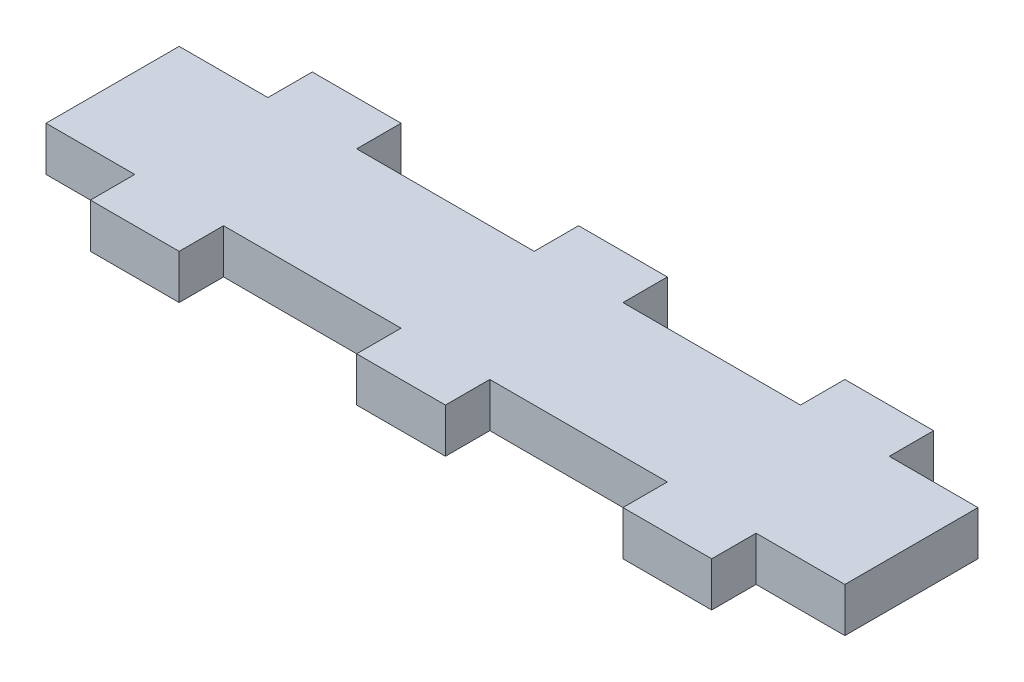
ISO-10303-21;
HEADER;
FILE_DESCRIPTION(('STEP AP214'),'2;1');
FILE_NAME('part.step','',(''),(''),'','','');
FILE_SCHEMA(('AUTOMOTIVE_DESIGN { 1 0 10303 214 1 1 1 1 }'));
ENDSEC;
DATA;
#1=APPLICATION_CONTEXT('core data for automotive mechanical design processes');
#2=APPLICATION_PROTOCOL_DEFINITION('international standard','automotive_design',2000,#1);
#3=PRODUCT_CONTEXT('',#1,'mechanical');
#4=PRODUCT('Part','Part','',(#3));
#5=PRODUCT_RELATED_PRODUCT_CATEGORY('part','',(#4));
#6=PRODUCT_DEFINITION_FORMATION('','',#4);
#7=PRODUCT_DEFINITION_CONTEXT('part definition',#1,'design');
#8=PRODUCT_DEFINITION('design','',#6,#7);
#9=PRODUCT_DEFINITION_SHAPE('','',#8);
#10=(LENGTH_UNIT() NAMED_UNIT(*) SI_UNIT(.MILLI.,.METRE.));
#11=(NAMED_UNIT(*) PLANE_ANGLE_UNIT() SI_UNIT($,.RADIAN.));
#12=(NAMED_UNIT(*) SI_UNIT($,.STERADIAN.) SOLID_ANGLE_UNIT());
#13=UNCERTAINTY_MEASURE_WITH_UNIT(LENGTH_MEASURE(1.E-05),#10,'distance_accuracy_value','');
#14=(GEOMETRIC_REPRESENTATION_CONTEXT(3) GLOBAL_UNCERTAINTY_ASSIGNED_CONTEXT((#13)) GLOBAL_UNIT_ASSIGNED_CONTEXT((#10,
#11,#12)) REPRESENTATION_CONTEXT('',''));
#15=CARTESIAN_POINT('',(0.,0.,0.));
#16=DIRECTION('',(0.,0.,1.));
#17=DIRECTION('',(1.,0.,0.));
#18=AXIS2_PLACEMENT_3D('',#15,#16,#17);
#19=CARTESIAN_POINT('',(-57.15,3.175,9.525));
#20=DIRECTION('',(0.,0.,-1.));
#21=DIRECTION('',(-1.,0.,0.));
#22=AXIS2_PLACEMENT_3D('',#19,#20,#21);
#23=PLANE('',#22);
#24=DIRECTION('',(0.,1.,0.));
#25=VECTOR('',#24,1.);
#26=CARTESIAN_POINT('',(6.35,-17.3740316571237,9.525));
#27=LINE('',#26,#25);
#28=CARTESIAN_POINT('',(6.35,-3.175,9.525));
#29=VERTEX_POINT('',#28);
#30=CARTESIAN_POINT('',(6.35,3.175,9.525));
#31=VERTEX_POINT('',#30);
#32=EDGE_CURVE('E255',#29,#31,#27,.T.);
#33=ORIENTED_EDGE('',*,*,#32,.F.);
#34=DIRECTION('',(1.,0.,0.));
#35=VECTOR('',#34,1.);
#36=CARTESIAN_POINT('',(-57.15,-3.175,9.525));
#37=LINE('',#36,#35);
#38=CARTESIAN_POINT('',(31.75,-3.175,9.525));
#39=VERTEX_POINT('',#38);
#40=EDGE_CURVE('E325',#29,#39,#37,.T.);
#41=ORIENTED_EDGE('',*,*,#40,.T.);
#42=DIRECTION('',(0.,1.,0.));
#43=VECTOR('',#42,1.);
#44=CARTESIAN_POINT('',(31.75,-17.3740316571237,9.52500000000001));
#45=LINE('',#44,#43);
#46=CARTESIAN_POINT('',(31.75,3.175,9.525));
#47=VERTEX_POINT('',#46);
#48=EDGE_CURVE('E278',#39,#47,#45,.T.);
#49=ORIENTED_EDGE('',*,*,#48,.T.);
#50=DIRECTION('',(1.,0.,0.));
#51=VECTOR('',#50,1.);
#52=CARTESIAN_POINT('',(-57.15,3.175,9.525));
#53=LINE('',#52,#51);
#54=EDGE_CURVE('E38',#31,#47,#53,.T.);
#55=ORIENTED_EDGE('',*,*,#54,.F.);
#56=EDGE_LOOP('',(#33,#41,#49,#55));
#57=FACE_BOUND('',#56,.T.);
#58=ADVANCED_FACE('F34',(#57),#23,.F.);
#59=DIRECTION('',(0.,1.,0.));
#60=VECTOR('',#59,1.);
#61=CARTESIAN_POINT('',(-6.35,-17.3740316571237,9.525));
#62=LINE('',#61,#60);
#63=CARTESIAN_POINT('',(-6.35,-3.175,9.525));
#64=VERTEX_POINT('',#63);
#65=CARTESIAN_POINT('',(-6.35,3.175,9.525));
#66=VERTEX_POINT('',#65);
#67=EDGE_CURVE('E59',#64,#66,#62,.T.);
#68=ORIENTED_EDGE('',*,*,#67,.T.);
#69=CARTESIAN_POINT('',(-31.75,3.175,9.525));
#70=VERTEX_POINT('',#69);
#71=EDGE_CURVE('E247',#70,#66,#53,.T.);
#72=ORIENTED_EDGE('',*,*,#71,.F.);
#73=DIRECTION('',(0.,1.,0.));
#74=VECTOR('',#73,1.);
#75=CARTESIAN_POINT('',(-31.75,-17.3740316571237,9.525));
#76=LINE('',#75,#74);
#77=CARTESIAN_POINT('',(-31.75,-3.175,9.525));
#78=VERTEX_POINT('',#77);
#79=EDGE_CURVE('E302',#78,#70,#76,.T.);
#80=ORIENTED_EDGE('',*,*,#79,.F.);
#81=EDGE_CURVE('E337',#78,#64,#37,.T.);
#82=ORIENTED_EDGE('',*,*,#81,.T.);
#83=EDGE_LOOP('',(#68,#72,#80,#82));
#84=FACE_BOUND('',#83,.T.);
#85=ADVANCED_FACE('F542',(#84),#23,.F.);
#86=DIRECTION('',(0.,1.,0.));
#87=VECTOR('',#86,1.);
#88=CARTESIAN_POINT('',(44.45,-17.3740316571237,9.525));
#89=LINE('',#88,#87);
#90=CARTESIAN_POINT('',(44.45,-3.175,9.525));
#91=VERTEX_POINT('',#90);
#92=CARTESIAN_POINT('',(44.45,3.175,9.525));
#93=VERTEX_POINT('',#92);
#94=EDGE_CURVE('E280',#91,#93,#89,.T.);
#95=ORIENTED_EDGE('',*,*,#94,.F.);
#96=CARTESIAN_POINT('',(57.15,-3.175,9.525));
#97=VERTEX_POINT('',#96);
#98=EDGE_CURVE('E322',#91,#97,#37,.T.);
#99=ORIENTED_EDGE('',*,*,#98,.T.);
#100=DIRECTION('',(0.,-1.,0.));
#101=VECTOR('',#100,1.);
#102=CARTESIAN_POINT('',(57.15,3.175,9.525));
#103=LINE('',#102,#101);
#104=CARTESIAN_POINT('',(57.15,3.175,9.525));
#105=VERTEX_POINT('',#104);
#106=EDGE_CURVE('E332',#105,#97,#103,.T.);
#107=ORIENTED_EDGE('',*,*,#106,.F.);
#108=EDGE_CURVE('E327',#93,#105,#53,.T.);
#109=ORIENTED_EDGE('',*,*,#108,.F.);
#110=EDGE_LOOP('',(#95,#99,#107,#109));
#111=FACE_BOUND('',#110,.T.);
#112=ADVANCED_FACE('F540',(#111),#23,.F.);
#113=CARTESIAN_POINT('',(-57.15,3.175,-9.525));
#114=DIRECTION('',(0.,0.,1.));
#115=DIRECTION('',(1.,0.,0.));
#116=AXIS2_PLACEMENT_3D('',#113,#114,#115);
#117=PLANE('',#116);
#118=DIRECTION('',(-1.,0.,0.));
#119=VECTOR('',#118,1.);
#120=CARTESIAN_POINT('',(-57.15,3.175,-9.525));
#121=LINE('',#120,#119);
#122=CARTESIAN_POINT('',(-6.35,3.175,-9.525));
#123=VERTEX_POINT('',#122);
#124=CARTESIAN_POINT('',(-31.75,3.175,-9.525));
#125=VERTEX_POINT('',#124);
#126=EDGE_CURVE('E345',#123,#125,#121,.T.);
#127=ORIENTED_EDGE('',*,*,#126,.F.);
#128=DIRECTION('',(0.,1.,0.));
#129=VECTOR('',#128,1.);
#130=CARTESIAN_POINT('',(-6.35,-17.3740316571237,-9.525));
#131=LINE('',#130,#129);
#132=CARTESIAN_POINT('',(-6.35,-3.175,-9.525));
#133=VERTEX_POINT('',#132);
#134=EDGE_CURVE('E435',#133,#123,#131,.T.);
#135=ORIENTED_EDGE('',*,*,#134,.F.);
#136=DIRECTION('',(-1.,0.,0.));
#137=VECTOR('',#136,1.);
#138=CARTESIAN_POINT('',(-57.15,-3.175,-9.525));
#139=LINE('',#138,#137);
#140=CARTESIAN_POINT('',(-31.75,-3.175,-9.525));
#141=VERTEX_POINT('',#140);
#142=EDGE_CURVE('E350',#133,#141,#139,.T.);
#143=ORIENTED_EDGE('',*,*,#142,.T.);
#144=DIRECTION('',(0.,1.,0.));
#145=VECTOR('',#144,1.);
#146=CARTESIAN_POINT('',(-31.75,-17.3740316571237,-9.525));
#147=LINE('',#146,#145);
#148=EDGE_CURVE('E481',#141,#125,#147,.T.);
#149=ORIENTED_EDGE('',*,*,#148,.T.);
#150=EDGE_LOOP('',(#127,#135,#143,#149));
#151=FACE_BOUND('',#150,.T.);
#152=ADVANCED_FACE('F509',(#151),#117,.F.);
#153=CARTESIAN_POINT('',(31.75,-3.175,-9.52500000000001));
#154=VERTEX_POINT('',#153);
#155=CARTESIAN_POINT('',(6.35,-3.175,-9.525));
#156=VERTEX_POINT('',#155);
#157=EDGE_CURVE('E367',#154,#156,#139,.T.);
#158=ORIENTED_EDGE('',*,*,#157,.T.);
#159=DIRECTION('',(0.,1.,0.));
#160=VECTOR('',#159,1.);
#161=CARTESIAN_POINT('',(6.35,-17.3740316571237,-9.525));
#162=LINE('',#161,#160);
#163=CARTESIAN_POINT('',(6.35,3.175,-9.525));
#164=VERTEX_POINT('',#163);
#165=EDGE_CURVE('E439',#156,#164,#162,.T.);
#166=ORIENTED_EDGE('',*,*,#165,.T.);
#167=CARTESIAN_POINT('',(31.75,3.175,-9.525));
#168=VERTEX_POINT('',#167);
#169=EDGE_CURVE('E348',#168,#164,#121,.T.);
#170=ORIENTED_EDGE('',*,*,#169,.F.);
#171=DIRECTION('',(0.,1.,0.));
#172=VECTOR('',#171,1.);
#173=CARTESIAN_POINT('',(31.75,-17.3740316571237,-9.52500000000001));
#174=LINE('',#173,#172);
#175=EDGE_CURVE('E460',#154,#168,#174,.T.);
#176=ORIENTED_EDGE('',*,*,#175,.F.);
#177=EDGE_LOOP('',(#158,#166,#170,#176));
#178=FACE_BOUND('',#177,.T.);
#179=ADVANCED_FACE('F548',(#178),#117,.F.);
#180=DIRECTION('',(0.,1.,0.));
#181=VECTOR('',#180,1.);
#182=CARTESIAN_POINT('',(-44.45,-17.3740316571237,-9.52499999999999));
#183=LINE('',#182,#181);
#184=CARTESIAN_POINT('',(-44.45,-3.175,-9.525));
#185=VERTEX_POINT('',#184);
#186=CARTESIAN_POINT('',(-44.45,3.175,-9.52499999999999));
#187=VERTEX_POINT('',#186);
#188=EDGE_CURVE('E475',#185,#187,#183,.T.);
#189=ORIENTED_EDGE('',*,*,#188,.F.);
#190=CARTESIAN_POINT('',(-57.15,-3.175,-9.525));
#191=VERTEX_POINT('',#190);
#192=EDGE_CURVE('E377',#185,#191,#139,.T.);
#193=ORIENTED_EDGE('',*,*,#192,.T.);
#194=DIRECTION('',(0.,-1.,0.));
#195=VECTOR('',#194,1.);
#196=CARTESIAN_POINT('',(-57.15,3.175,-9.525));
#197=LINE('',#196,#195);
#198=CARTESIAN_POINT('',(-57.15,3.175,-9.525));
#199=VERTEX_POINT('',#198);
#200=EDGE_CURVE('E44',#199,#191,#197,.T.);
#201=ORIENTED_EDGE('',*,*,#200,.F.);
#202=EDGE_CURVE('E349',#187,#199,#121,.T.);
#203=ORIENTED_EDGE('',*,*,#202,.F.);
#204=EDGE_LOOP('',(#189,#193,#201,#203));
#205=FACE_BOUND('',#204,.T.);
#206=ADVANCED_FACE('F524',(#205),#117,.F.);
#207=CARTESIAN_POINT('',(57.15,3.175,-9.525));
#208=DIRECTION('',(-1.,0.,0.));
#209=DIRECTION('',(0.,0.,1.));
#210=AXIS2_PLACEMENT_3D('',#207,#208,#209);
#211=PLANE('',#210);
#212=DIRECTION('',(0.,0.,-1.));
#213=VECTOR('',#212,1.);
#214=CARTESIAN_POINT('',(57.15,-3.175,-9.525));
#215=LINE('',#214,#213);
#216=CARTESIAN_POINT('',(57.15,-3.175,-9.525));
#217=VERTEX_POINT('',#216);
#218=EDGE_CURVE('E374',#97,#217,#215,.T.);
#219=ORIENTED_EDGE('',*,*,#218,.T.);
#220=DIRECTION('',(0.,-1.,0.));
#221=VECTOR('',#220,1.);
#222=CARTESIAN_POINT('',(57.15,3.175,-9.525));
#223=LINE('',#222,#221);
#224=CARTESIAN_POINT('',(57.15,3.175,-9.525));
#225=VERTEX_POINT('',#224);
#226=EDGE_CURVE('E11',#225,#217,#223,.T.);
#227=ORIENTED_EDGE('',*,*,#226,.F.);
#228=DIRECTION('',(0.,0.,-1.));
#229=VECTOR('',#228,1.);
#230=CARTESIAN_POINT('',(57.15,3.175,-9.525));
#231=LINE('',#230,#229);
#232=EDGE_CURVE('E344',#105,#225,#231,.T.);
#233=ORIENTED_EDGE('',*,*,#232,.F.);
#234=ORIENTED_EDGE('',*,*,#106,.T.);
#235=EDGE_LOOP('',(#219,#227,#233,#234));
#236=FACE_BOUND('',#235,.T.);
#237=ADVANCED_FACE('F36',(#236),#211,.F.);
#238=CARTESIAN_POINT('',(44.45,-3.175,-9.525));
#239=VERTEX_POINT('',#238);
#240=EDGE_CURVE('E369',#217,#239,#139,.T.);
#241=ORIENTED_EDGE('',*,*,#240,.T.);
#242=DIRECTION('',(0.,1.,0.));
#243=VECTOR('',#242,1.);
#244=CARTESIAN_POINT('',(44.45,-17.3740316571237,-9.525));
#245=LINE('',#244,#243);
#246=CARTESIAN_POINT('',(44.45,3.175,-9.525));
#247=VERTEX_POINT('',#246);
#248=EDGE_CURVE('E464',#239,#247,#245,.T.);
#249=ORIENTED_EDGE('',*,*,#248,.T.);
#250=EDGE_CURVE('E363',#225,#247,#121,.T.);
#251=ORIENTED_EDGE('',*,*,#250,.F.);
#252=ORIENTED_EDGE('',*,*,#226,.T.);
#253=EDGE_LOOP('',(#241,#249,#251,#252));
#254=FACE_BOUND('',#253,.T.);
#255=ADVANCED_FACE('F518',(#254),#117,.F.);
#256=CARTESIAN_POINT('',(-57.15,3.175,-9.525));
#257=DIRECTION('',(1.,0.,0.));
#258=DIRECTION('',(0.,0.,-1.));
#259=AXIS2_PLACEMENT_3D('',#256,#257,#258);
#260=PLANE('',#259);
#261=DIRECTION('',(0.,0.,1.));
#262=VECTOR('',#261,1.);
#263=CARTESIAN_POINT('',(-57.15,-3.175,-9.525));
#264=LINE('',#263,#262);
#265=CARTESIAN_POINT('',(-57.15,-3.175,9.525));
#266=VERTEX_POINT('',#265);
#267=EDGE_CURVE('E326',#191,#266,#264,.T.);
#268=ORIENTED_EDGE('',*,*,#267,.T.);
#269=DIRECTION('',(0.,-1.,0.));
#270=VECTOR('',#269,1.);
#271=CARTESIAN_POINT('',(-57.15,3.175,9.525));
#272=LINE('',#271,#270);
#273=CARTESIAN_POINT('',(-57.15,3.175,9.525));
#274=VERTEX_POINT('',#273);
#275=EDGE_CURVE('E382',#274,#266,#272,.T.);
#276=ORIENTED_EDGE('',*,*,#275,.F.);
#277=DIRECTION('',(0.,0.,1.));
#278=VECTOR('',#277,1.);
#279=CARTESIAN_POINT('',(-57.15,3.175,-9.525));
#280=LINE('',#279,#278);
#281=EDGE_CURVE('E356',#199,#274,#280,.T.);
#282=ORIENTED_EDGE('',*,*,#281,.F.);
#283=ORIENTED_EDGE('',*,*,#200,.T.);
#284=EDGE_LOOP('',(#268,#276,#282,#283));
#285=FACE_BOUND('',#284,.T.);
#286=ADVANCED_FACE('F526',(#285),#260,.F.);
#287=CARTESIAN_POINT('',(-44.45,-3.175,9.52499999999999));
#288=VERTEX_POINT('',#287);
#289=EDGE_CURVE('E341',#266,#288,#37,.T.);
#290=ORIENTED_EDGE('',*,*,#289,.T.);
#291=DIRECTION('',(0.,1.,0.));
#292=VECTOR('',#291,1.);
#293=CARTESIAN_POINT('',(-44.45,-17.3740316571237,9.52499999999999));
#294=LINE('',#293,#292);
#295=CARTESIAN_POINT('',(-44.45,3.175,9.525));
#296=VERTEX_POINT('',#295);
#297=EDGE_CURVE('E297',#288,#296,#294,.T.);
#298=ORIENTED_EDGE('',*,*,#297,.T.);
#299=EDGE_CURVE('E389',#274,#296,#53,.T.);
#300=ORIENTED_EDGE('',*,*,#299,.F.);
#301=ORIENTED_EDGE('',*,*,#275,.T.);
#302=EDGE_LOOP('',(#290,#298,#300,#301));
#303=FACE_BOUND('',#302,.T.);
#304=ADVANCED_FACE('F407',(#303),#23,.F.);
#305=CARTESIAN_POINT('',(0.,3.175,0.));
#306=DIRECTION('',(0.,1.,0.));
#307=DIRECTION('',(0.,0.,1.));
#308=AXIS2_PLACEMENT_3D('',#305,#306,#307);
#309=PLANE('',#308);
#310=ORIENTED_EDGE('',*,*,#232,.T.);
#311=ORIENTED_EDGE('',*,*,#250,.T.);
#312=DIRECTION('',(0.,0.,-1.));
#313=VECTOR('',#312,1.);
#314=CARTESIAN_POINT('',(44.45,3.175,-9.525));
#315=LINE('',#314,#313);
#316=CARTESIAN_POINT('',(44.45,3.175,-15.875));
#317=VERTEX_POINT('',#316);
#318=EDGE_CURVE('E454',#247,#317,#315,.T.);
#319=ORIENTED_EDGE('',*,*,#318,.T.);
#320=DIRECTION('',(-1.,0.,0.));
#321=VECTOR('',#320,1.);
#322=CARTESIAN_POINT('',(31.75,3.175,-15.875));
#323=LINE('',#322,#321);
#324=CARTESIAN_POINT('',(31.75,3.175,-15.875));
#325=VERTEX_POINT('',#324);
#326=EDGE_CURVE('E457',#317,#325,#323,.T.);
#327=ORIENTED_EDGE('',*,*,#326,.T.);
#328=DIRECTION('',(0.,0.,1.));
#329=VECTOR('',#328,1.);
#330=CARTESIAN_POINT('',(31.75,3.175,-9.52500000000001));
#331=LINE('',#330,#329);
#332=EDGE_CURVE('E426',#325,#168,#331,.T.);
#333=ORIENTED_EDGE('',*,*,#332,.T.);
#334=ORIENTED_EDGE('',*,*,#169,.T.);
#335=DIRECTION('',(0.,0.,-1.));
#336=VECTOR('',#335,1.);
#337=CARTESIAN_POINT('',(6.35,3.175,-9.525));
#338=LINE('',#337,#336);
#339=CARTESIAN_POINT('',(6.35,3.175,-15.875));
#340=VERTEX_POINT('',#339);
#341=EDGE_CURVE('E429',#164,#340,#338,.T.);
#342=ORIENTED_EDGE('',*,*,#341,.T.);
#343=DIRECTION('',(-1.,0.,0.));
#344=VECTOR('',#343,1.);
#345=CARTESIAN_POINT('',(-6.35,3.175,-15.875));
#346=LINE('',#345,#344);
#347=CARTESIAN_POINT('',(-6.35,3.175,-15.875));
#348=VERTEX_POINT('',#347);
#349=EDGE_CURVE('E432',#340,#348,#346,.T.);
#350=ORIENTED_EDGE('',*,*,#349,.T.);
#351=DIRECTION('',(0.,0.,1.));
#352=VECTOR('',#351,1.);
#353=CARTESIAN_POINT('',(-6.35,3.175,-9.525));
#354=LINE('',#353,#352);
#355=EDGE_CURVE('E308',#348,#123,#354,.T.);
#356=ORIENTED_EDGE('',*,*,#355,.T.);
#357=ORIENTED_EDGE('',*,*,#126,.T.);
#358=DIRECTION('',(0.,0.,-1.));
#359=VECTOR('',#358,1.);
#360=CARTESIAN_POINT('',(-31.75,3.175,-9.525));
#361=LINE('',#360,#359);
#362=CARTESIAN_POINT('',(-31.75,3.175,-15.875));
#363=VERTEX_POINT('',#362);
#364=EDGE_CURVE('E476',#125,#363,#361,.T.);
#365=ORIENTED_EDGE('',*,*,#364,.T.);
#366=DIRECTION('',(-1.,0.,0.));
#367=VECTOR('',#366,1.);
#368=CARTESIAN_POINT('',(-44.45,3.175,-15.875));
#369=LINE('',#368,#367);
#370=CARTESIAN_POINT('',(-44.45,3.175,-15.875));
#371=VERTEX_POINT('',#370);
#372=EDGE_CURVE('E472',#363,#371,#369,.T.);
#373=ORIENTED_EDGE('',*,*,#372,.T.);
#374=DIRECTION('',(0.,0.,1.));
#375=VECTOR('',#374,1.);
#376=CARTESIAN_POINT('',(-44.45,3.175,-9.52499999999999));
#377=LINE('',#376,#375);
#378=EDGE_CURVE('E451',#371,#187,#377,.T.);
#379=ORIENTED_EDGE('',*,*,#378,.T.);
#380=ORIENTED_EDGE('',*,*,#202,.T.);
#381=ORIENTED_EDGE('',*,*,#281,.T.);
#382=ORIENTED_EDGE('',*,*,#299,.T.);
#383=DIRECTION('',(0.,0.,-1.));
#384=VECTOR('',#383,1.);
#385=CARTESIAN_POINT('',(-44.45,3.175,9.52499999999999));
#386=LINE('',#385,#384);
#387=CARTESIAN_POINT('',(-44.45,3.175,15.875));
#388=VERTEX_POINT('',#387);
#389=EDGE_CURVE('E267',#388,#296,#386,.T.);
#390=ORIENTED_EDGE('',*,*,#389,.F.);
#391=DIRECTION('',(-1.,0.,0.));
#392=VECTOR('',#391,1.);
#393=CARTESIAN_POINT('',(-44.45,3.175,15.875));
#394=LINE('',#393,#392);
#395=CARTESIAN_POINT('',(-31.75,3.175,15.875));
#396=VERTEX_POINT('',#395);
#397=EDGE_CURVE('E288',#396,#388,#394,.T.);
#398=ORIENTED_EDGE('',*,*,#397,.F.);
#399=DIRECTION('',(0.,0.,1.));
#400=VECTOR('',#399,1.);
#401=CARTESIAN_POINT('',(-31.75,3.175,9.525));
#402=LINE('',#401,#400);
#403=EDGE_CURVE('E291',#70,#396,#402,.T.);
#404=ORIENTED_EDGE('',*,*,#403,.F.);
#405=ORIENTED_EDGE('',*,*,#71,.T.);
#406=DIRECTION('',(0.,0.,-1.));
#407=VECTOR('',#406,1.);
#408=CARTESIAN_POINT('',(-6.35,3.175,9.525));
#409=LINE('',#408,#407);
#410=CARTESIAN_POINT('',(-6.35,3.175,15.875));
#411=VERTEX_POINT('',#410);
#412=EDGE_CURVE('E228',#411,#66,#409,.T.);
#413=ORIENTED_EDGE('',*,*,#412,.F.);
#414=DIRECTION('',(-1.,0.,0.));
#415=VECTOR('',#414,1.);
#416=CARTESIAN_POINT('',(-6.35,3.175,15.875));
#417=LINE('',#416,#415);
#418=CARTESIAN_POINT('',(6.35,3.175,15.875));
#419=VERTEX_POINT('',#418);
#420=EDGE_CURVE('E237',#419,#411,#417,.T.);
#421=ORIENTED_EDGE('',*,*,#420,.F.);
#422=DIRECTION('',(0.,0.,1.));
#423=VECTOR('',#422,1.);
#424=CARTESIAN_POINT('',(6.35,3.175,9.525));
#425=LINE('',#424,#423);
#426=EDGE_CURVE('E234',#31,#419,#425,.T.);
#427=ORIENTED_EDGE('',*,*,#426,.F.);
#428=ORIENTED_EDGE('',*,*,#54,.T.);
#429=DIRECTION('',(0.,0.,-1.));
#430=VECTOR('',#429,1.);
#431=CARTESIAN_POINT('',(31.75,3.175,9.52500000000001));
#432=LINE('',#431,#430);
#433=CARTESIAN_POINT('',(31.75,3.175,15.875));
#434=VERTEX_POINT('',#433);
#435=EDGE_CURVE('E268',#434,#47,#432,.T.);
#436=ORIENTED_EDGE('',*,*,#435,.F.);
#437=DIRECTION('',(-1.,0.,0.));
#438=VECTOR('',#437,1.);
#439=CARTESIAN_POINT('',(31.75,3.175,15.875));
#440=LINE('',#439,#438);
#441=CARTESIAN_POINT('',(44.45,3.175,15.875));
#442=VERTEX_POINT('',#441);
#443=EDGE_CURVE('E271',#442,#434,#440,.T.);
#444=ORIENTED_EDGE('',*,*,#443,.F.);
#445=DIRECTION('',(0.,0.,1.));
#446=VECTOR('',#445,1.);
#447=CARTESIAN_POINT('',(44.45,3.175,9.525));
#448=LINE('',#447,#446);
#449=EDGE_CURVE('E274',#93,#442,#448,.T.);
#450=ORIENTED_EDGE('',*,*,#449,.F.);
#451=ORIENTED_EDGE('',*,*,#108,.T.);
#452=EDGE_LOOP('',(#310,#311,#319,#327,#333,#334,#342,#350,#356,#357,#365,#373,#379,#380,#381,
#382,#390,#398,#404,#405,#413,#421,#427,#428,#436,#444,#450,#451));
#453=FACE_BOUND('',#452,.T.);
#454=ADVANCED_FACE('F245',(#453),#309,.T.);
#455=CARTESIAN_POINT('',(0.,-3.175,0.));
#456=DIRECTION('',(0.,1.,0.));
#457=DIRECTION('',(0.,0.,1.));
#458=AXIS2_PLACEMENT_3D('',#455,#456,#457);
#459=PLANE('',#458);
#460=ORIENTED_EDGE('',*,*,#218,.F.);
#461=ORIENTED_EDGE('',*,*,#98,.F.);
#462=DIRECTION('',(0.,0.,-1.));
#463=VECTOR('',#462,1.);
#464=CARTESIAN_POINT('',(44.45,-3.175,9.525));
#465=LINE('',#464,#463);
#466=CARTESIAN_POINT('',(44.45,-3.175,15.875));
#467=VERTEX_POINT('',#466);
#468=EDGE_CURVE('E260',#467,#91,#465,.T.);
#469=ORIENTED_EDGE('',*,*,#468,.F.);
#470=DIRECTION('',(1.,0.,0.));
#471=VECTOR('',#470,1.);
#472=CARTESIAN_POINT('',(31.75,-3.175,15.875));
#473=LINE('',#472,#471);
#474=CARTESIAN_POINT('',(31.75,-3.175,15.875));
#475=VERTEX_POINT('',#474);
#476=EDGE_CURVE('E264',#475,#467,#473,.T.);
#477=ORIENTED_EDGE('',*,*,#476,.F.);
#478=DIRECTION('',(0.,0.,1.));
#479=VECTOR('',#478,1.);
#480=CARTESIAN_POINT('',(31.75,-3.175,9.52500000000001));
#481=LINE('',#480,#479);
#482=EDGE_CURVE('E263',#39,#475,#481,.T.);
#483=ORIENTED_EDGE('',*,*,#482,.F.);
#484=ORIENTED_EDGE('',*,*,#40,.F.);
#485=DIRECTION('',(0.,0.,-1.));
#486=VECTOR('',#485,1.);
#487=CARTESIAN_POINT('',(6.35,-3.175,9.525));
#488=LINE('',#487,#486);
#489=CARTESIAN_POINT('',(6.35,-3.175,15.875));
#490=VERTEX_POINT('',#489);
#491=EDGE_CURVE('E259',#490,#29,#488,.T.);
#492=ORIENTED_EDGE('',*,*,#491,.F.);
#493=DIRECTION('',(1.,0.,0.));
#494=VECTOR('',#493,1.);
#495=CARTESIAN_POINT('',(-6.35,-3.175,15.875));
#496=LINE('',#495,#494);
#497=CARTESIAN_POINT('',(-6.35,-3.175,15.875));
#498=VERTEX_POINT('',#497);
#499=EDGE_CURVE('E254',#498,#490,#496,.T.);
#500=ORIENTED_EDGE('',*,*,#499,.F.);
#501=DIRECTION('',(0.,0.,1.));
#502=VECTOR('',#501,1.);
#503=CARTESIAN_POINT('',(-6.35,-3.175,9.525));
#504=LINE('',#503,#502);
#505=EDGE_CURVE('E230',#64,#498,#504,.T.);
#506=ORIENTED_EDGE('',*,*,#505,.F.);
#507=ORIENTED_EDGE('',*,*,#81,.F.);
#508=DIRECTION('',(0.,0.,-1.));
#509=VECTOR('',#508,1.);
#510=CARTESIAN_POINT('',(-31.75,-3.175,9.525));
#511=LINE('',#510,#509);
#512=CARTESIAN_POINT('',(-31.75,-3.175,15.875));
#513=VERTEX_POINT('',#512);
#514=EDGE_CURVE('E309',#513,#78,#511,.T.);
#515=ORIENTED_EDGE('',*,*,#514,.F.);
#516=DIRECTION('',(1.,0.,0.));
#517=VECTOR('',#516,1.);
#518=CARTESIAN_POINT('',(-44.45,-3.175,15.875));
#519=LINE('',#518,#517);
#520=CARTESIAN_POINT('',(-44.45,-3.175,15.875));
#521=VERTEX_POINT('',#520);
#522=EDGE_CURVE('E301',#521,#513,#519,.T.);
#523=ORIENTED_EDGE('',*,*,#522,.F.);
#524=DIRECTION('',(0.,0.,1.));
#525=VECTOR('',#524,1.);
#526=CARTESIAN_POINT('',(-44.45,-3.175,9.52499999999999));
#527=LINE('',#526,#525);
#528=EDGE_CURVE('E305',#288,#521,#527,.T.);
#529=ORIENTED_EDGE('',*,*,#528,.F.);
#530=ORIENTED_EDGE('',*,*,#289,.F.);
#531=ORIENTED_EDGE('',*,*,#267,.F.);
#532=ORIENTED_EDGE('',*,*,#192,.F.);
#533=DIRECTION('',(0.,0.,-1.));
#534=VECTOR('',#533,1.);
#535=CARTESIAN_POINT('',(-44.45,-3.175,-9.52499999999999));
#536=LINE('',#535,#534);
#537=CARTESIAN_POINT('',(-44.45,-3.175,-15.875));
#538=VERTEX_POINT('',#537);
#539=EDGE_CURVE('E470',#185,#538,#536,.T.);
#540=ORIENTED_EDGE('',*,*,#539,.T.);
#541=DIRECTION('',(1.,0.,0.));
#542=VECTOR('',#541,1.);
#543=CARTESIAN_POINT('',(-44.45,-3.175,-15.875));
#544=LINE('',#543,#542);
#545=CARTESIAN_POINT('',(-31.75,-3.175,-15.875));
#546=VERTEX_POINT('',#545);
#547=EDGE_CURVE('E468',#538,#546,#544,.T.);
#548=ORIENTED_EDGE('',*,*,#547,.T.);
#549=DIRECTION('',(0.,0.,1.));
#550=VECTOR('',#549,1.);
#551=CARTESIAN_POINT('',(-31.75,-3.175,-9.525));
#552=LINE('',#551,#550);
#553=EDGE_CURVE('E471',#546,#141,#552,.T.);
#554=ORIENTED_EDGE('',*,*,#553,.T.);
#555=ORIENTED_EDGE('',*,*,#142,.F.);
#556=DIRECTION('',(0.,0.,-1.));
#557=VECTOR('',#556,1.);
#558=CARTESIAN_POINT('',(-6.35,-3.175,-9.525));
#559=LINE('',#558,#557);
#560=CARTESIAN_POINT('',(-6.35,-3.175,-15.875));
#561=VERTEX_POINT('',#560);
#562=EDGE_CURVE('E424',#133,#561,#559,.T.);
#563=ORIENTED_EDGE('',*,*,#562,.T.);
#564=DIRECTION('',(1.,0.,0.));
#565=VECTOR('',#564,1.);
#566=CARTESIAN_POINT('',(-6.35,-3.175,-15.875));
#567=LINE('',#566,#565);
#568=CARTESIAN_POINT('',(6.35,-3.175,-15.875));
#569=VERTEX_POINT('',#568);
#570=EDGE_CURVE('E421',#561,#569,#567,.T.);
#571=ORIENTED_EDGE('',*,*,#570,.T.);
#572=DIRECTION('',(0.,0.,1.));
#573=VECTOR('',#572,1.);
#574=CARTESIAN_POINT('',(6.35,-3.175,-9.525));
#575=LINE('',#574,#573);
#576=EDGE_CURVE('E418',#569,#156,#575,.T.);
#577=ORIENTED_EDGE('',*,*,#576,.T.);
#578=ORIENTED_EDGE('',*,*,#157,.F.);
#579=DIRECTION('',(0.,0.,-1.));
#580=VECTOR('',#579,1.);
#581=CARTESIAN_POINT('',(31.75,-3.175,-9.52500000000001));
#582=LINE('',#581,#580);
#583=CARTESIAN_POINT('',(31.75,-3.175,-15.875));
#584=VERTEX_POINT('',#583);
#585=EDGE_CURVE('E449',#154,#584,#582,.T.);
#586=ORIENTED_EDGE('',*,*,#585,.T.);
#587=DIRECTION('',(1.,0.,0.));
#588=VECTOR('',#587,1.);
#589=CARTESIAN_POINT('',(31.75,-3.175,-15.875));
#590=LINE('',#589,#588);
#591=CARTESIAN_POINT('',(44.45,-3.175,-15.875));
#592=VERTEX_POINT('',#591);
#593=EDGE_CURVE('E446',#584,#592,#590,.T.);
#594=ORIENTED_EDGE('',*,*,#593,.T.);
#595=DIRECTION('',(0.,0.,1.));
#596=VECTOR('',#595,1.);
#597=CARTESIAN_POINT('',(44.45,-3.175,-9.525));
#598=LINE('',#597,#596);
#599=EDGE_CURVE('E443',#592,#239,#598,.T.);
#600=ORIENTED_EDGE('',*,*,#599,.T.);
#601=ORIENTED_EDGE('',*,*,#240,.F.);
#602=EDGE_LOOP('',(#460,#461,#469,#477,#483,#484,#492,#500,#506,#507,#515,#523,#529,#530,#531,
#532,#540,#548,#554,#555,#563,#571,#577,#578,#586,#594,#600,#601));
#603=FACE_BOUND('',#602,.T.);
#604=ADVANCED_FACE('F410',(#603),#459,.F.);
#605=CARTESIAN_POINT('',(-44.45,-17.3740316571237,-9.52499999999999));
#606=DIRECTION('',(-1.,0.,0.));
#607=DIRECTION('',(0.,0.,1.));
#608=AXIS2_PLACEMENT_3D('',#605,#606,#607);
#609=PLANE('',#608);
#610=ORIENTED_EDGE('',*,*,#539,.F.);
#611=ORIENTED_EDGE('',*,*,#188,.T.);
#612=ORIENTED_EDGE('',*,*,#378,.F.);
#613=DIRECTION('',(0.,1.,0.));
#614=VECTOR('',#613,1.);
#615=CARTESIAN_POINT('',(-44.45,-17.3740316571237,-15.875));
#616=LINE('',#615,#614);
#617=EDGE_CURVE('E477',#538,#371,#616,.T.);
#618=ORIENTED_EDGE('',*,*,#617,.F.);
#619=EDGE_LOOP('',(#610,#611,#612,#618));
#620=FACE_BOUND('',#619,.T.);
#621=ADVANCED_FACE('F592',(#620),#609,.T.);
#622=CARTESIAN_POINT('',(-44.45,-17.3740316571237,-15.875));
#623=DIRECTION('',(0.,0.,-1.));
#624=DIRECTION('',(-1.,0.,0.));
#625=AXIS2_PLACEMENT_3D('',#622,#623,#624);
#626=PLANE('',#625);
#627=ORIENTED_EDGE('',*,*,#547,.F.);
#628=ORIENTED_EDGE('',*,*,#617,.T.);
#629=ORIENTED_EDGE('',*,*,#372,.F.);
#630=DIRECTION('',(0.,1.,0.));
#631=VECTOR('',#630,1.);
#632=CARTESIAN_POINT('',(-31.75,-17.3740316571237,-15.875));
#633=LINE('',#632,#631);
#634=EDGE_CURVE('E479',#546,#363,#633,.T.);
#635=ORIENTED_EDGE('',*,*,#634,.F.);
#636=EDGE_LOOP('',(#627,#628,#629,#635));
#637=FACE_BOUND('',#636,.T.);
#638=ADVANCED_FACE('F698',(#637),#626,.T.);
#639=CARTESIAN_POINT('',(-31.75,-17.3740316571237,-9.525));
#640=DIRECTION('',(1.,0.,0.));
#641=DIRECTION('',(0.,0.,-1.));
#642=AXIS2_PLACEMENT_3D('',#639,#640,#641);
#643=PLANE('',#642);
#644=ORIENTED_EDGE('',*,*,#553,.F.);
#645=ORIENTED_EDGE('',*,*,#634,.T.);
#646=ORIENTED_EDGE('',*,*,#364,.F.);
#647=ORIENTED_EDGE('',*,*,#148,.F.);
#648=EDGE_LOOP('',(#644,#645,#646,#647));
#649=FACE_BOUND('',#648,.T.);
#650=ADVANCED_FACE('F507',(#649),#643,.T.);
#651=CARTESIAN_POINT('',(31.75,-17.3740316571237,-9.52500000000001));
#652=DIRECTION('',(-1.,0.,0.));
#653=DIRECTION('',(0.,0.,1.));
#654=AXIS2_PLACEMENT_3D('',#651,#652,#653);
#655=PLANE('',#654);
#656=ORIENTED_EDGE('',*,*,#585,.F.);
#657=ORIENTED_EDGE('',*,*,#175,.T.);
#658=ORIENTED_EDGE('',*,*,#332,.F.);
#659=DIRECTION('',(0.,1.,0.));
#660=VECTOR('',#659,1.);
#661=CARTESIAN_POINT('',(31.75,-17.3740316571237,-15.875));
#662=LINE('',#661,#660);
#663=EDGE_CURVE('E447',#584,#325,#662,.T.);
#664=ORIENTED_EDGE('',*,*,#663,.F.);
#665=EDGE_LOOP('',(#656,#657,#658,#664));
#666=FACE_BOUND('',#665,.T.);
#667=ADVANCED_FACE('F690',(#666),#655,.T.);
#668=CARTESIAN_POINT('',(31.75,-17.3740316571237,-15.875));
#669=DIRECTION('',(0.,0.,-1.));
#670=DIRECTION('',(-1.,0.,0.));
#671=AXIS2_PLACEMENT_3D('',#668,#669,#670);
#672=PLANE('',#671);
#673=ORIENTED_EDGE('',*,*,#593,.F.);
#674=ORIENTED_EDGE('',*,*,#663,.T.);
#675=ORIENTED_EDGE('',*,*,#326,.F.);
#676=DIRECTION('',(0.,1.,0.));
#677=VECTOR('',#676,1.);
#678=CARTESIAN_POINT('',(44.45,-17.3740316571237,-15.875));
#679=LINE('',#678,#677);
#680=EDGE_CURVE('E462',#592,#317,#679,.T.);
#681=ORIENTED_EDGE('',*,*,#680,.F.);
#682=EDGE_LOOP('',(#673,#674,#675,#681));
#683=FACE_BOUND('',#682,.T.);
#684=ADVANCED_FACE('F687',(#683),#672,.T.);
#685=CARTESIAN_POINT('',(44.45,-17.3740316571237,-9.525));
#686=DIRECTION('',(1.,0.,0.));
#687=DIRECTION('',(0.,0.,-1.));
#688=AXIS2_PLACEMENT_3D('',#685,#686,#687);
#689=PLANE('',#688);
#690=ORIENTED_EDGE('',*,*,#599,.F.);
#691=ORIENTED_EDGE('',*,*,#680,.T.);
#692=ORIENTED_EDGE('',*,*,#318,.F.);
#693=ORIENTED_EDGE('',*,*,#248,.F.);
#694=EDGE_LOOP('',(#690,#691,#692,#693));
#695=FACE_BOUND('',#694,.T.);
#696=ADVANCED_FACE('F685',(#695),#689,.T.);
#697=CARTESIAN_POINT('',(-6.35,-17.3740316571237,-9.525));
#698=DIRECTION('',(-1.,0.,0.));
#699=DIRECTION('',(0.,0.,1.));
#700=AXIS2_PLACEMENT_3D('',#697,#698,#699);
#701=PLANE('',#700);
#702=ORIENTED_EDGE('',*,*,#562,.F.);
#703=ORIENTED_EDGE('',*,*,#134,.T.);
#704=ORIENTED_EDGE('',*,*,#355,.F.);
#705=DIRECTION('',(0.,1.,0.));
#706=VECTOR('',#705,1.);
#707=CARTESIAN_POINT('',(-6.35,-17.3740316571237,-15.875));
#708=LINE('',#707,#706);
#709=EDGE_CURVE('E422',#561,#348,#708,.T.);
#710=ORIENTED_EDGE('',*,*,#709,.F.);
#711=EDGE_LOOP('',(#702,#703,#704,#710));
#712=FACE_BOUND('',#711,.T.);
#713=ADVANCED_FACE('F679',(#712),#701,.T.);
#714=CARTESIAN_POINT('',(-6.35,-17.3740316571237,-15.875));
#715=DIRECTION('',(0.,0.,-1.));
#716=DIRECTION('',(-1.,0.,0.));
#717=AXIS2_PLACEMENT_3D('',#714,#715,#716);
#718=PLANE('',#717);
#719=ORIENTED_EDGE('',*,*,#570,.F.);
#720=ORIENTED_EDGE('',*,*,#709,.T.);
#721=ORIENTED_EDGE('',*,*,#349,.F.);
#722=DIRECTION('',(0.,1.,0.));
#723=VECTOR('',#722,1.);
#724=CARTESIAN_POINT('',(6.35,-17.3740316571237,-15.875));
#725=LINE('',#724,#723);
#726=EDGE_CURVE('E437',#569,#340,#725,.T.);
#727=ORIENTED_EDGE('',*,*,#726,.F.);
#728=EDGE_LOOP('',(#719,#720,#721,#727));
#729=FACE_BOUND('',#728,.T.);
#730=ADVANCED_FACE('F676',(#729),#718,.T.);
#731=CARTESIAN_POINT('',(6.35,-17.3740316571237,-9.525));
#732=DIRECTION('',(1.,0.,0.));
#733=DIRECTION('',(0.,0.,-1.));
#734=AXIS2_PLACEMENT_3D('',#731,#732,#733);
#735=PLANE('',#734);
#736=ORIENTED_EDGE('',*,*,#576,.F.);
#737=ORIENTED_EDGE('',*,*,#726,.T.);
#738=ORIENTED_EDGE('',*,*,#341,.F.);
#739=ORIENTED_EDGE('',*,*,#165,.F.);
#740=EDGE_LOOP('',(#736,#737,#738,#739));
#741=FACE_BOUND('',#740,.T.);
#742=ADVANCED_FACE('F603',(#741),#735,.T.);
#743=CARTESIAN_POINT('',(-44.45,-17.3740316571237,15.875));
#744=DIRECTION('',(0.,0.,-1.));
#745=DIRECTION('',(-1.,0.,0.));
#746=AXIS2_PLACEMENT_3D('',#743,#744,#745);
#747=PLANE('',#746);
#748=DIRECTION('',(0.,1.,0.));
#749=VECTOR('',#748,1.);
#750=CARTESIAN_POINT('',(-44.45,-17.3740316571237,15.875));
#751=LINE('',#750,#749);
#752=EDGE_CURVE('E319',#521,#388,#751,.T.);
#753=ORIENTED_EDGE('',*,*,#752,.F.);
#754=ORIENTED_EDGE('',*,*,#522,.T.);
#755=DIRECTION('',(0.,1.,0.));
#756=VECTOR('',#755,1.);
#757=CARTESIAN_POINT('',(-31.75,-17.3740316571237,15.875));
#758=LINE('',#757,#756);
#759=EDGE_CURVE('E313',#513,#396,#758,.T.);
#760=ORIENTED_EDGE('',*,*,#759,.T.);
#761=ORIENTED_EDGE('',*,*,#397,.T.);
#762=EDGE_LOOP('',(#753,#754,#760,#761));
#763=FACE_BOUND('',#762,.T.);
#764=ADVANCED_FACE('F414',(#763),#747,.F.);
#765=CARTESIAN_POINT('',(-31.75,-17.3740316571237,9.525));
#766=DIRECTION('',(-1.,0.,0.));
#767=DIRECTION('',(0.,0.,1.));
#768=AXIS2_PLACEMENT_3D('',#765,#766,#767);
#769=PLANE('',#768);
#770=ORIENTED_EDGE('',*,*,#759,.F.);
#771=ORIENTED_EDGE('',*,*,#514,.T.);
#772=ORIENTED_EDGE('',*,*,#79,.T.);
#773=ORIENTED_EDGE('',*,*,#403,.T.);
#774=EDGE_LOOP('',(#770,#771,#772,#773));
#775=FACE_BOUND('',#774,.T.);
#776=ADVANCED_FACE('F602',(#775),#769,.F.);
#777=CARTESIAN_POINT('',(-44.45,-17.3740316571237,9.52499999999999));
#778=DIRECTION('',(1.,0.,0.));
#779=DIRECTION('',(0.,0.,-1.));
#780=AXIS2_PLACEMENT_3D('',#777,#778,#779);
#781=PLANE('',#780);
#782=ORIENTED_EDGE('',*,*,#297,.F.);
#783=ORIENTED_EDGE('',*,*,#528,.T.);
#784=ORIENTED_EDGE('',*,*,#752,.T.);
#785=ORIENTED_EDGE('',*,*,#389,.T.);
#786=EDGE_LOOP('',(#782,#783,#784,#785));
#787=FACE_BOUND('',#786,.T.);
#788=ADVANCED_FACE('F404',(#787),#781,.F.);
#789=CARTESIAN_POINT('',(31.75,-17.3740316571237,15.875));
#790=DIRECTION('',(0.,0.,-1.));
#791=DIRECTION('',(-1.,0.,0.));
#792=AXIS2_PLACEMENT_3D('',#789,#790,#791);
#793=PLANE('',#792);
#794=DIRECTION('',(0.,1.,0.));
#795=VECTOR('',#794,1.);
#796=CARTESIAN_POINT('',(31.75,-17.3740316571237,15.875));
#797=LINE('',#796,#795);
#798=EDGE_CURVE('E277',#475,#434,#797,.T.);
#799=ORIENTED_EDGE('',*,*,#798,.F.);
#800=ORIENTED_EDGE('',*,*,#476,.T.);
#801=DIRECTION('',(0.,1.,0.));
#802=VECTOR('',#801,1.);
#803=CARTESIAN_POINT('',(44.45,-17.3740316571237,15.875));
#804=LINE('',#803,#802);
#805=EDGE_CURVE('E283',#467,#442,#804,.T.);
#806=ORIENTED_EDGE('',*,*,#805,.T.);
#807=ORIENTED_EDGE('',*,*,#443,.T.);
#808=EDGE_LOOP('',(#799,#800,#806,#807));
#809=FACE_BOUND('',#808,.T.);
#810=ADVANCED_FACE('F535',(#809),#793,.F.);
#811=CARTESIAN_POINT('',(44.45,-17.3740316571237,9.525));
#812=DIRECTION('',(-1.,0.,0.));
#813=DIRECTION('',(0.,0.,1.));
#814=AXIS2_PLACEMENT_3D('',#811,#812,#813);
#815=PLANE('',#814);
#816=ORIENTED_EDGE('',*,*,#805,.F.);
#817=ORIENTED_EDGE('',*,*,#468,.T.);
#818=ORIENTED_EDGE('',*,*,#94,.T.);
#819=ORIENTED_EDGE('',*,*,#449,.T.);
#820=EDGE_LOOP('',(#816,#817,#818,#819));
#821=FACE_BOUND('',#820,.T.);
#822=ADVANCED_FACE('F538',(#821),#815,.F.);
#823=CARTESIAN_POINT('',(31.75,-17.3740316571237,9.52500000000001));
#824=DIRECTION('',(1.,0.,0.));
#825=DIRECTION('',(0.,0.,-1.));
#826=AXIS2_PLACEMENT_3D('',#823,#824,#825);
#827=PLANE('',#826);
#828=ORIENTED_EDGE('',*,*,#48,.F.);
#829=ORIENTED_EDGE('',*,*,#482,.T.);
#830=ORIENTED_EDGE('',*,*,#798,.T.);
#831=ORIENTED_EDGE('',*,*,#435,.T.);
#832=EDGE_LOOP('',(#828,#829,#830,#831));
#833=FACE_BOUND('',#832,.T.);
#834=ADVANCED_FACE('F532',(#833),#827,.F.);
#835=CARTESIAN_POINT('',(-6.35,-17.3740316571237,15.875));
#836=DIRECTION('',(0.,0.,-1.));
#837=DIRECTION('',(-1.,0.,0.));
#838=AXIS2_PLACEMENT_3D('',#835,#836,#837);
#839=PLANE('',#838);
#840=DIRECTION('',(0.,1.,0.));
#841=VECTOR('',#840,1.);
#842=CARTESIAN_POINT('',(-6.35,-17.3740316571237,15.875));
#843=LINE('',#842,#841);
#844=EDGE_CURVE('E224',#498,#411,#843,.T.);
#845=ORIENTED_EDGE('',*,*,#844,.F.);
#846=ORIENTED_EDGE('',*,*,#499,.T.);
#847=DIRECTION('',(0.,1.,0.));
#848=VECTOR('',#847,1.);
#849=CARTESIAN_POINT('',(6.35,-17.3740316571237,15.875));
#850=LINE('',#849,#848);
#851=EDGE_CURVE('E233',#490,#419,#850,.T.);
#852=ORIENTED_EDGE('',*,*,#851,.T.);
#853=ORIENTED_EDGE('',*,*,#420,.T.);
#854=EDGE_LOOP('',(#845,#846,#852,#853));
#855=FACE_BOUND('',#854,.T.);
#856=ADVANCED_FACE('F238',(#855),#839,.F.);
#857=CARTESIAN_POINT('',(6.35,-17.3740316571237,9.525));
#858=DIRECTION('',(-1.,0.,0.));
#859=DIRECTION('',(0.,0.,1.));
#860=AXIS2_PLACEMENT_3D('',#857,#858,#859);
#861=PLANE('',#860);
#862=ORIENTED_EDGE('',*,*,#851,.F.);
#863=ORIENTED_EDGE('',*,*,#491,.T.);
#864=ORIENTED_EDGE('',*,*,#32,.T.);
#865=ORIENTED_EDGE('',*,*,#426,.T.);
#866=EDGE_LOOP('',(#862,#863,#864,#865));
#867=FACE_BOUND('',#866,.T.);
#868=ADVANCED_FACE('F654',(#867),#861,.F.);
#869=CARTESIAN_POINT('',(-6.35,-17.3740316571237,9.525));
#870=DIRECTION('',(1.,0.,0.));
#871=DIRECTION('',(0.,0.,-1.));
#872=AXIS2_PLACEMENT_3D('',#869,#870,#871);
#873=PLANE('',#872);
#874=ORIENTED_EDGE('',*,*,#67,.F.);
#875=ORIENTED_EDGE('',*,*,#505,.T.);
#876=ORIENTED_EDGE('',*,*,#844,.T.);
#877=ORIENTED_EDGE('',*,*,#412,.T.);
#878=EDGE_LOOP('',(#874,#875,#876,#877));
#879=FACE_BOUND('',#878,.T.);
#880=ADVANCED_FACE('F226',(#879),#873,.F.);
#881=CLOSED_SHELL('',(#58,#85,#112,#152,#179,#206,#237,#255,#286,#304,#454,#604,#621,#638,#650,
#667,#684,#696,#713,#730,#742,#764,#776,#788,#810,#822,#834,#856,#868,#880));
#882=MANIFOLD_SOLID_BREP('B2',#881);
#883=ADVANCED_BREP_SHAPE_REPRESENTATION('',(#18,#882),#14);
#884=SHAPE_DEFINITION_REPRESENTATION(#9,#883);
ENDSEC;
END-ISO-10303-21;
